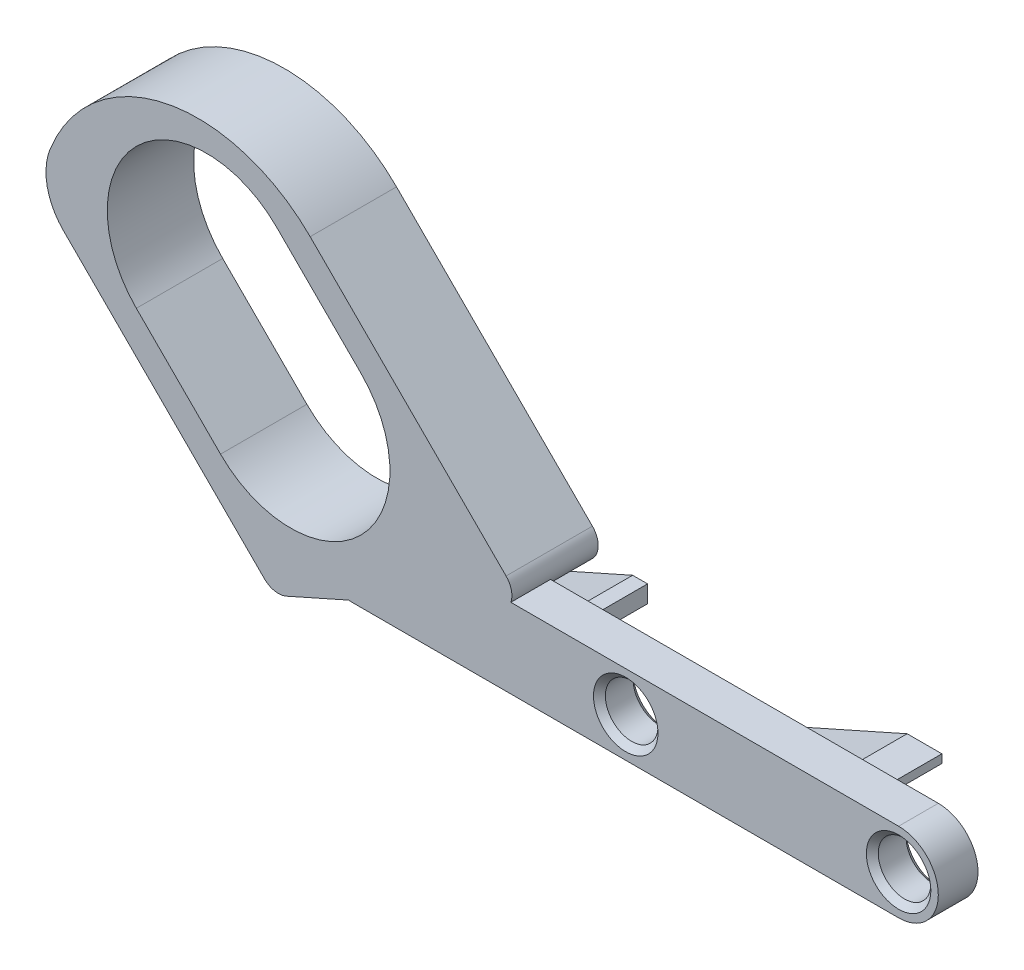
ISO-10303-21;
HEADER;
FILE_DESCRIPTION(('STEP AP214'),'2;1');
FILE_NAME('part.step','',(''),(''),'','','');
FILE_SCHEMA(('AUTOMOTIVE_DESIGN { 1 0 10303 214 1 1 1 1 }'));
ENDSEC;
DATA;
#1=APPLICATION_CONTEXT('core data for automotive mechanical design processes');
#2=APPLICATION_PROTOCOL_DEFINITION('international standard','automotive_design',2000,#1);
#3=PRODUCT_CONTEXT('',#1,'mechanical');
#4=PRODUCT('Part','Part','',(#3));
#5=PRODUCT_RELATED_PRODUCT_CATEGORY('part','',(#4));
#6=PRODUCT_DEFINITION_FORMATION('','',#4);
#7=PRODUCT_DEFINITION_CONTEXT('part definition',#1,'design');
#8=PRODUCT_DEFINITION('design','',#6,#7);
#9=PRODUCT_DEFINITION_SHAPE('','',#8);
#10=(LENGTH_UNIT() NAMED_UNIT(*) SI_UNIT(.MILLI.,.METRE.));
#11=(NAMED_UNIT(*) PLANE_ANGLE_UNIT() SI_UNIT($,.RADIAN.));
#12=(NAMED_UNIT(*) SI_UNIT($,.STERADIAN.) SOLID_ANGLE_UNIT());
#13=UNCERTAINTY_MEASURE_WITH_UNIT(LENGTH_MEASURE(1.E-05),#10,'distance_accuracy_value','');
#14=(GEOMETRIC_REPRESENTATION_CONTEXT(3) GLOBAL_UNCERTAINTY_ASSIGNED_CONTEXT((#13)) GLOBAL_UNIT_ASSIGNED_CONTEXT((#10,
#11,#12)) REPRESENTATION_CONTEXT('',''));
#15=CARTESIAN_POINT('',(0.,0.,0.));
#16=DIRECTION('',(0.,0.,1.));
#17=DIRECTION('',(1.,0.,0.));
#18=AXIS2_PLACEMENT_3D('',#15,#16,#17);
#19=CARTESIAN_POINT('',(-27.5,0.,0.));
#20=DIRECTION('',(0.,0.,1.));
#21=DIRECTION('',(1.,0.,0.));
#22=AXIS2_PLACEMENT_3D('',#19,#20,#21);
#23=PLANE('',#22);
#24=DIRECTION('',(0.913545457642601,0.406736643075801,0.));
#25=VECTOR('',#24,1.);
#26=CARTESIAN_POINT('',(-26.0911824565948,-3.16425601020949,0.));
#27=LINE('',#26,#25);
#28=CARTESIAN_POINT('',(-27.9188937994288,-3.97800552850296,0.));
#29=VERTEX_POINT('',#28);
#30=CARTESIAN_POINT('',(-12.6584337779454,2.81638902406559,0.));
#31=VERTEX_POINT('',#30);
#32=EDGE_CURVE('E335',#29,#31,#27,.T.);
#33=ORIENTED_EDGE('',*,*,#32,.T.);
#34=CARTESIAN_POINT('',(-13.471907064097,4.64347993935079,0.));
#35=DIRECTION('',(0.,0.,1.));
#36=DIRECTION('',(1.,0.,0.));
#37=AXIS2_PLACEMENT_3D('',#34,#35,#36);
#38=CIRCLE('',#37,2.);
#39=CARTESIAN_POINT('',(-11.5782509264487,4.,0.));
#40=VERTEX_POINT('',#39);
#41=EDGE_CURVE('E341',#31,#40,#38,.T.);
#42=ORIENTED_EDGE('',*,*,#41,.T.);
#43=DIRECTION('',(-1.,0.,0.));
#44=VECTOR('',#43,1.);
#45=CARTESIAN_POINT('',(-27.5,4.,0.));
#46=LINE('',#45,#44);
#47=CARTESIAN_POINT('',(27.5,4.00000000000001,0.));
#48=VERTEX_POINT('',#47);
#49=EDGE_CURVE('E438',#48,#40,#46,.T.);
#50=ORIENTED_EDGE('',*,*,#49,.F.);
#51=CARTESIAN_POINT('',(27.5,0.,0.));
#52=DIRECTION('',(0.,0.,1.));
#53=DIRECTION('',(1.,0.,0.));
#54=AXIS2_PLACEMENT_3D('',#51,#52,#53);
#55=CIRCLE('',#54,4.00000000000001);
#56=CARTESIAN_POINT('',(27.5,-4.00000000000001,0.));
#57=VERTEX_POINT('',#56);
#58=EDGE_CURVE('E449',#57,#48,#55,.T.);
#59=ORIENTED_EDGE('',*,*,#58,.F.);
#60=DIRECTION('',(1.,0.,0.));
#61=VECTOR('',#60,1.);
#62=CARTESIAN_POINT('',(-27.5,-4.,0.));
#63=LINE('',#62,#61);
#64=CARTESIAN_POINT('',(-27.5,-4.,0.));
#65=VERTEX_POINT('',#64);
#66=EDGE_CURVE('E447',#65,#57,#63,.T.);
#67=ORIENTED_EDGE('',*,*,#66,.F.);
#68=CARTESIAN_POINT('',(-27.5,0.,0.));
#69=DIRECTION('',(0.,0.,1.));
#70=DIRECTION('',(1.,0.,0.));
#71=AXIS2_PLACEMENT_3D('',#68,#69,#70);
#72=CIRCLE('',#71,4.);
#73=EDGE_CURVE('E434',#29,#65,#72,.T.);
#74=ORIENTED_EDGE('',*,*,#73,.F.);
#75=EDGE_LOOP('',(#33,#42,#50,#59,#67,#74));
#76=FACE_BOUND('',#75,.T.);
#77=DIRECTION('',(-1.,0.,0.));
#78=VECTOR('',#77,1.);
#79=CARTESIAN_POINT('',(8.,-3.8,0.));
#80=LINE('',#79,#78);
#81=CARTESIAN_POINT('',(8.,-3.8,0.));
#82=VERTEX_POINT('',#81);
#83=CARTESIAN_POINT('',(6.5,-3.8,0.));
#84=VERTEX_POINT('',#83);
#85=EDGE_CURVE('E410',#82,#84,#80,.T.);
#86=ORIENTED_EDGE('',*,*,#85,.F.);
#87=DIRECTION('',(-0.913545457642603,-0.406736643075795,0.));
#88=VECTOR('',#87,1.);
#89=CARTESIAN_POINT('',(23.160974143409,2.95010058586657,0.));
#90=LINE('',#89,#88);
#91=CARTESIAN_POINT('',(23.1609741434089,2.95010058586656,0.));
#92=VERTEX_POINT('',#91);
#93=EDGE_CURVE('E408',#92,#82,#90,.T.);
#94=ORIENTED_EDGE('',*,*,#93,.F.);
#95=DIRECTION('',(0.,-1.,0.));
#96=VECTOR('',#95,1.);
#97=CARTESIAN_POINT('',(23.160974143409,3.80000000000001,0.));
#98=LINE('',#97,#96);
#99=CARTESIAN_POINT('',(23.1609741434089,3.80000000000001,0.));
#100=VERTEX_POINT('',#99);
#101=EDGE_CURVE('E405',#100,#92,#98,.T.);
#102=ORIENTED_EDGE('',*,*,#101,.F.);
#103=DIRECTION('',(1.,0.,0.));
#104=VECTOR('',#103,1.);
#105=CARTESIAN_POINT('',(19.660974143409,3.80000000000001,0.));
#106=LINE('',#105,#104);
#107=CARTESIAN_POINT('',(19.660974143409,3.80000000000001,0.));
#108=VERTEX_POINT('',#107);
#109=EDGE_CURVE('E387',#108,#100,#106,.T.);
#110=ORIENTED_EDGE('',*,*,#109,.F.);
#111=DIRECTION('',(0.913545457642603,0.406736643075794,0.));
#112=VECTOR('',#111,1.);
#113=CARTESIAN_POINT('',(6.5,-2.0596432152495,0.));
#114=LINE('',#113,#112);
#115=CARTESIAN_POINT('',(6.5,-2.0596432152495,0.));
#116=VERTEX_POINT('',#115);
#117=EDGE_CURVE('E392',#116,#108,#114,.T.);
#118=ORIENTED_EDGE('',*,*,#117,.F.);
#119=DIRECTION('',(0.,1.,0.));
#120=VECTOR('',#119,1.);
#121=CARTESIAN_POINT('',(6.5,-3.8,0.));
#122=LINE('',#121,#120);
#123=EDGE_CURVE('E413',#84,#116,#122,.T.);
#124=ORIENTED_EDGE('',*,*,#123,.F.);
#125=EDGE_LOOP('',(#86,#94,#102,#110,#118,#124));
#126=FACE_BOUND('',#125,.T.);
#127=DIRECTION('',(0.913545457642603,0.406736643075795,0.));
#128=VECTOR('',#127,1.);
#129=CARTESIAN_POINT('',(-23.160974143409,-2.95010058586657,0.));
#130=LINE('',#129,#128);
#131=CARTESIAN_POINT('',(-23.160974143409,-2.95010058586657,0.));
#132=VERTEX_POINT('',#131);
#133=CARTESIAN_POINT('',(-8.,3.8,0.));
#134=VERTEX_POINT('',#133);
#135=EDGE_CURVE('E60',#132,#134,#130,.T.);
#136=ORIENTED_EDGE('',*,*,#135,.F.);
#137=DIRECTION('',(0.,1.,0.));
#138=VECTOR('',#137,1.);
#139=CARTESIAN_POINT('',(-23.160974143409,-3.80000000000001,0.));
#140=LINE('',#139,#138);
#141=CARTESIAN_POINT('',(-23.160974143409,-3.80000000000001,0.));
#142=VERTEX_POINT('',#141);
#143=EDGE_CURVE('E363',#142,#132,#140,.T.);
#144=ORIENTED_EDGE('',*,*,#143,.F.);
#145=DIRECTION('',(-1.,0.,0.));
#146=VECTOR('',#145,1.);
#147=CARTESIAN_POINT('',(-19.660974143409,-3.80000000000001,0.));
#148=LINE('',#147,#146);
#149=CARTESIAN_POINT('',(-19.660974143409,-3.80000000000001,0.));
#150=VERTEX_POINT('',#149);
#151=EDGE_CURVE('E344',#150,#142,#148,.T.);
#152=ORIENTED_EDGE('',*,*,#151,.F.);
#153=DIRECTION('',(-0.913545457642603,-0.406736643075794,0.));
#154=VECTOR('',#153,1.);
#155=CARTESIAN_POINT('',(-6.5,2.0596432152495,0.));
#156=LINE('',#155,#154);
#157=CARTESIAN_POINT('',(-6.5,2.0596432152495,0.));
#158=VERTEX_POINT('',#157);
#159=EDGE_CURVE('E349',#158,#150,#156,.T.);
#160=ORIENTED_EDGE('',*,*,#159,.F.);
#161=DIRECTION('',(0.,-1.,0.));
#162=VECTOR('',#161,1.);
#163=CARTESIAN_POINT('',(-6.5,3.8,0.));
#164=LINE('',#163,#162);
#165=CARTESIAN_POINT('',(-6.5,3.8,0.));
#166=VERTEX_POINT('',#165);
#167=EDGE_CURVE('E67',#166,#158,#164,.T.);
#168=ORIENTED_EDGE('',*,*,#167,.F.);
#169=DIRECTION('',(1.,0.,0.));
#170=VECTOR('',#169,1.);
#171=CARTESIAN_POINT('',(-8.,3.8,0.));
#172=LINE('',#171,#170);
#173=EDGE_CURVE('E367',#134,#166,#172,.T.);
#174=ORIENTED_EDGE('',*,*,#173,.F.);
#175=EDGE_LOOP('',(#136,#144,#152,#160,#168,#174));
#176=FACE_BOUND('',#175,.T.);
#177=CARTESIAN_POINT('',(27.5,0.,0.));
#178=DIRECTION('',(0.,0.,1.));
#179=DIRECTION('',(1.,0.,0.));
#180=AXIS2_PLACEMENT_3D('',#177,#178,#179);
#181=CIRCLE('',#180,3.24999999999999);
#182=CARTESIAN_POINT('',(30.75,0.,0.));
#183=VERTEX_POINT('',#182);
#184=EDGE_CURVE('E473',#183,#183,#181,.T.);
#185=ORIENTED_EDGE('',*,*,#184,.T.);
#186=EDGE_LOOP('',(#185));
#187=FACE_BOUND('',#186,.T.);
#188=CARTESIAN_POINT('',(0.,0.,0.));
#189=DIRECTION('',(0.,0.,1.));
#190=DIRECTION('',(1.,0.,0.));
#191=AXIS2_PLACEMENT_3D('',#188,#189,#190);
#192=CIRCLE('',#191,3.25);
#193=CARTESIAN_POINT('',(3.25,0.,0.));
#194=VERTEX_POINT('',#193);
#195=EDGE_CURVE('E461',#194,#194,#192,.T.);
#196=ORIENTED_EDGE('',*,*,#195,.T.);
#197=EDGE_LOOP('',(#196));
#198=FACE_BOUND('',#197,.T.);
#199=ADVANCED_FACE('F44',(#76,#126,#176,#187,#198),#23,.F.);
#200=CARTESIAN_POINT('',(-27.5,0.,4.));
#201=DIRECTION('',(0.,0.,-1.));
#202=DIRECTION('',(-1.,0.,0.));
#203=AXIS2_PLACEMENT_3D('',#200,#201,#202);
#204=CYLINDRICAL_SURFACE('',#203,4.);
#205=CARTESIAN_POINT('',(-27.5,0.,4.));
#206=DIRECTION('',(0.,0.,1.));
#207=DIRECTION('',(1.,0.,0.));
#208=AXIS2_PLACEMENT_3D('',#205,#206,#207);
#209=CIRCLE('',#208,4.);
#210=CARTESIAN_POINT('',(-27.9188937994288,-3.97800552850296,4.));
#211=VERTEX_POINT('',#210);
#212=CARTESIAN_POINT('',(-27.5,-4.,4.));
#213=VERTEX_POINT('',#212);
#214=EDGE_CURVE('E435',#211,#213,#209,.T.);
#215=ORIENTED_EDGE('',*,*,#214,.F.);
#216=DIRECTION('',(0.,0.,-1.));
#217=VECTOR('',#216,1.);
#218=CARTESIAN_POINT('',(-27.9188937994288,-3.97800552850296,4.));
#219=LINE('',#218,#217);
#220=EDGE_CURVE('E295',#211,#29,#219,.T.);
#221=ORIENTED_EDGE('',*,*,#220,.T.);
#222=ORIENTED_EDGE('',*,*,#73,.T.);
#223=DIRECTION('',(0.,0.,-1.));
#224=VECTOR('',#223,1.);
#225=CARTESIAN_POINT('',(-27.5,-4.,4.));
#226=LINE('',#225,#224);
#227=EDGE_CURVE('E458',#213,#65,#226,.T.);
#228=ORIENTED_EDGE('',*,*,#227,.F.);
#229=EDGE_LOOP('',(#215,#221,#222,#228));
#230=FACE_BOUND('',#229,.T.);
#231=ADVANCED_FACE('F500',(#230),#204,.T.);
#232=CARTESIAN_POINT('',(-27.5,-4.,4.));
#233=DIRECTION('',(0.,1.,0.));
#234=DIRECTION('',(0.,0.,1.));
#235=AXIS2_PLACEMENT_3D('',#232,#233,#234);
#236=PLANE('',#235);
#237=ORIENTED_EDGE('',*,*,#66,.T.);
#238=DIRECTION('',(0.,0.,-1.));
#239=VECTOR('',#238,1.);
#240=CARTESIAN_POINT('',(27.5,-4.00000000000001,4.));
#241=LINE('',#240,#239);
#242=CARTESIAN_POINT('',(27.5,-4.00000000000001,4.));
#243=VERTEX_POINT('',#242);
#244=EDGE_CURVE('E455',#243,#57,#241,.T.);
#245=ORIENTED_EDGE('',*,*,#244,.F.);
#246=DIRECTION('',(1.,0.,0.));
#247=VECTOR('',#246,1.);
#248=CARTESIAN_POINT('',(-27.5,-4.,4.));
#249=LINE('',#248,#247);
#250=EDGE_CURVE('E437',#213,#243,#249,.T.);
#251=ORIENTED_EDGE('',*,*,#250,.F.);
#252=ORIENTED_EDGE('',*,*,#227,.T.);
#253=EDGE_LOOP('',(#237,#245,#251,#252));
#254=FACE_BOUND('',#253,.T.);
#255=ADVANCED_FACE('F507',(#254),#236,.F.);
#256=CARTESIAN_POINT('',(27.5,0.,4.));
#257=DIRECTION('',(0.,0.,-1.));
#258=DIRECTION('',(-1.,0.,0.));
#259=AXIS2_PLACEMENT_3D('',#256,#257,#258);
#260=CYLINDRICAL_SURFACE('',#259,4.00000000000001);
#261=ORIENTED_EDGE('',*,*,#58,.T.);
#262=DIRECTION('',(0.,0.,-1.));
#263=VECTOR('',#262,1.);
#264=CARTESIAN_POINT('',(27.5,4.00000000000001,4.));
#265=LINE('',#264,#263);
#266=CARTESIAN_POINT('',(27.5,4.00000000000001,4.));
#267=VERTEX_POINT('',#266);
#268=EDGE_CURVE('E445',#267,#48,#265,.T.);
#269=ORIENTED_EDGE('',*,*,#268,.F.);
#270=CARTESIAN_POINT('',(27.5,0.,4.));
#271=DIRECTION('',(0.,0.,1.));
#272=DIRECTION('',(1.,0.,0.));
#273=AXIS2_PLACEMENT_3D('',#270,#271,#272);
#274=CIRCLE('',#273,4.00000000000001);
#275=EDGE_CURVE('E440',#243,#267,#274,.T.);
#276=ORIENTED_EDGE('',*,*,#275,.F.);
#277=ORIENTED_EDGE('',*,*,#244,.T.);
#278=EDGE_LOOP('',(#261,#269,#276,#277));
#279=FACE_BOUND('',#278,.T.);
#280=ADVANCED_FACE('F517',(#279),#260,.T.);
#281=CARTESIAN_POINT('',(-27.5,4.,4.));
#282=DIRECTION('',(0.,-1.,0.));
#283=DIRECTION('',(1.,0.,0.));
#284=AXIS2_PLACEMENT_3D('',#281,#282,#283);
#285=PLANE('',#284);
#286=ORIENTED_EDGE('',*,*,#49,.T.);
#287=DIRECTION('',(0.,0.,1.));
#288=VECTOR('',#287,1.);
#289=CARTESIAN_POINT('',(-11.5782509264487,4.,-64.7424043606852));
#290=LINE('',#289,#288);
#291=CARTESIAN_POINT('',(-11.5782509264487,4.,4.));
#292=VERTEX_POINT('',#291);
#293=EDGE_CURVE('E338',#40,#292,#290,.T.);
#294=ORIENTED_EDGE('',*,*,#293,.T.);
#295=DIRECTION('',(-1.,0.,0.));
#296=VECTOR('',#295,1.);
#297=CARTESIAN_POINT('',(-27.5,4.,4.));
#298=LINE('',#297,#296);
#299=EDGE_CURVE('E442',#267,#292,#298,.T.);
#300=ORIENTED_EDGE('',*,*,#299,.F.);
#301=ORIENTED_EDGE('',*,*,#268,.T.);
#302=EDGE_LOOP('',(#286,#294,#300,#301));
#303=FACE_BOUND('',#302,.T.);
#304=ADVANCED_FACE('F514',(#303),#285,.F.);
#305=CARTESIAN_POINT('',(-27.5,0.,4.));
#306=DIRECTION('',(0.,0.,1.));
#307=DIRECTION('',(1.,0.,0.));
#308=AXIS2_PLACEMENT_3D('',#305,#306,#307);
#309=PLANE('',#308);
#310=DIRECTION('',(-0.707106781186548,0.707106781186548,0.));
#311=VECTOR('',#310,1.);
#312=CARTESIAN_POINT('',(-26.6899169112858,16.4472762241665,4.));
#313=LINE('',#312,#311);
#314=CARTESIAN_POINT('',(-26.6899169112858,16.4472762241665,4.));
#315=VERTEX_POINT('',#314);
#316=CARTESIAN_POINT('',(-35.1751982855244,24.9325575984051,4.));
#317=VERTEX_POINT('',#316);
#318=EDGE_CURVE('E258',#315,#317,#313,.T.);
#319=ORIENTED_EDGE('',*,*,#318,.F.);
#320=CARTESIAN_POINT('',(-33.7609847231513,9.37620841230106,4.));
#321=DIRECTION('',(0.,0.,1.));
#322=DIRECTION('',(1.,0.,0.));
#323=AXIS2_PLACEMENT_3D('',#320,#321,#322);
#324=CIRCLE('',#323,10.);
#325=CARTESIAN_POINT('',(-40.8320525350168,2.30514060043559,4.));
#326=VERTEX_POINT('',#325);
#327=EDGE_CURVE('E253',#326,#315,#324,.T.);
#328=ORIENTED_EDGE('',*,*,#327,.F.);
#329=DIRECTION('',(0.707106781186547,-0.707106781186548,0.));
#330=VECTOR('',#329,1.);
#331=CARTESIAN_POINT('',(-40.8320525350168,2.30514060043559,4.));
#332=LINE('',#331,#330);
#333=CARTESIAN_POINT('',(-49.3173339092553,10.7904219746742,4.));
#334=VERTEX_POINT('',#333);
#335=EDGE_CURVE('E235',#334,#326,#332,.T.);
#336=ORIENTED_EDGE('',*,*,#335,.F.);
#337=CARTESIAN_POINT('',(-42.2462660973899,17.8614897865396,4.));
#338=DIRECTION('',(0.,0.,1.));
#339=DIRECTION('',(1.,0.,0.));
#340=AXIS2_PLACEMENT_3D('',#337,#338,#339);
#341=CIRCLE('',#340,10.);
#342=EDGE_CURVE('E251',#317,#334,#341,.T.);
#343=ORIENTED_EDGE('',*,*,#342,.F.);
#344=EDGE_LOOP('',(#319,#328,#336,#343));
#345=FACE_BOUND('',#344,.T.);
#346=DIRECTION('',(0.913545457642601,0.406736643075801,0.));
#347=VECTOR('',#346,1.);
#348=CARTESIAN_POINT('',(-12.6584337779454,2.81638902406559,4.));
#349=LINE('',#348,#347);
#350=CARTESIAN_POINT('',(-34.1863059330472,-6.76843719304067,4.));
#351=VERTEX_POINT('',#350);
#352=EDGE_CURVE('E277',#351,#211,#349,.T.);
#353=ORIENTED_EDGE('',*,*,#352,.T.);
#354=ORIENTED_EDGE('',*,*,#214,.T.);
#355=ORIENTED_EDGE('',*,*,#250,.T.);
#356=ORIENTED_EDGE('',*,*,#275,.T.);
#357=ORIENTED_EDGE('',*,*,#299,.T.);
#358=CARTESIAN_POINT('',(-13.471907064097,4.64347993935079,4.));
#359=DIRECTION('',(0.,0.,1.));
#360=DIRECTION('',(1.,0.,0.));
#361=AXIS2_PLACEMENT_3D('',#358,#359,#360);
#362=CIRCLE('',#361,2.);
#363=CARTESIAN_POINT('',(-12.0576935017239,6.05769350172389,4.));
#364=VERTEX_POINT('',#363);
#365=EDGE_CURVE('E275',#292,#364,#362,.T.);
#366=ORIENTED_EDGE('',*,*,#365,.T.);
#367=DIRECTION('',(-0.707106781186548,0.707106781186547,0.));
#368=VECTOR('',#367,1.);
#369=CARTESIAN_POINT('',(-12.0576935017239,6.05769350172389,4.));
#370=LINE('',#369,#368);
#371=CARTESIAN_POINT('',(-31.7992221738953,25.7992221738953,4.));
#372=VERTEX_POINT('',#371);
#373=EDGE_CURVE('E272',#364,#372,#370,.T.);
#374=ORIENTED_EDGE('',*,*,#373,.T.);
#375=CARTESIAN_POINT('',(-43.1129306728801,14.4855136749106,4.));
#376=DIRECTION('',(0.,0.,1.));
#377=DIRECTION('',(1.,0.,0.));
#378=AXIS2_PLACEMENT_3D('',#375,#376,#377);
#379=CIRCLE('',#378,16.);
#380=CARTESIAN_POINT('',(-58.0075991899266,20.3292153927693,4.));
#381=VERTEX_POINT('',#380);
#382=EDGE_CURVE('E269',#372,#381,#379,.T.);
#383=ORIENTED_EDGE('',*,*,#382,.T.);
#384=CARTESIAN_POINT('',(-52.4220984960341,18.1378272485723,4.));
#385=DIRECTION('',(0.,0.,1.));
#386=DIRECTION('',(1.,0.,0.));
#387=AXIS2_PLACEMENT_3D('',#384,#385,#386);
#388=CIRCLE('',#387,6.00000000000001);
#389=CARTESIAN_POINT('',(-56.6647391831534,13.895186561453,4.));
#390=VERTEX_POINT('',#389);
#391=EDGE_CURVE('E266',#381,#390,#388,.T.);
#392=ORIENTED_EDGE('',*,*,#391,.T.);
#393=DIRECTION('',(0.707106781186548,-0.707106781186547,0.));
#394=VECTOR('',#393,1.);
#395=CARTESIAN_POINT('',(-36.4139927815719,-6.35555984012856,4.));
#396=LINE('',#395,#394);
#397=CARTESIAN_POINT('',(-36.4139927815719,-6.35555984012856,4.));
#398=VERTEX_POINT('',#397);
#399=EDGE_CURVE('E263',#390,#398,#396,.T.);
#400=ORIENTED_EDGE('',*,*,#399,.T.);
#401=CARTESIAN_POINT('',(-34.9997792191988,-4.94134627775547,4.));
#402=DIRECTION('',(0.,0.,1.));
#403=DIRECTION('',(1.,0.,0.));
#404=AXIS2_PLACEMENT_3D('',#401,#402,#403);
#405=CIRCLE('',#404,2.);
#406=EDGE_CURVE('E255',#398,#351,#405,.T.);
#407=ORIENTED_EDGE('',*,*,#406,.T.);
#408=EDGE_LOOP('',(#353,#354,#355,#356,#357,#366,#374,#383,#392,#400,#407));
#409=FACE_BOUND('',#408,.T.);
#410=CARTESIAN_POINT('',(27.5,0.,4.));
#411=DIRECTION('',(0.,0.,1.));
#412=DIRECTION('',(1.,0.,0.));
#413=AXIS2_PLACEMENT_3D('',#410,#411,#412);
#414=CIRCLE('',#413,3.24999999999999);
#415=CARTESIAN_POINT('',(30.75,0.,4.));
#416=VERTEX_POINT('',#415);
#417=EDGE_CURVE('E11',#416,#416,#414,.F.);
#418=ORIENTED_EDGE('',*,*,#417,.T.);
#419=EDGE_LOOP('',(#418));
#420=FACE_BOUND('',#419,.T.);
#421=CARTESIAN_POINT('',(0.,0.,4.));
#422=DIRECTION('',(0.,0.,1.));
#423=DIRECTION('',(1.,0.,0.));
#424=AXIS2_PLACEMENT_3D('',#421,#422,#423);
#425=CIRCLE('',#424,3.24999999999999);
#426=CARTESIAN_POINT('',(3.24999999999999,0.,4.));
#427=VERTEX_POINT('',#426);
#428=EDGE_CURVE('E470',#427,#427,#425,.F.);
#429=ORIENTED_EDGE('',*,*,#428,.T.);
#430=EDGE_LOOP('',(#429));
#431=FACE_BOUND('',#430,.T.);
#432=ADVANCED_FACE('F249',(#345,#409,#420,#431),#309,.T.);
#433=CARTESIAN_POINT('',(27.5,0.,0.));
#434=DIRECTION('',(0.,0.,1.));
#435=DIRECTION('',(1.,0.,0.));
#436=AXIS2_PLACEMENT_3D('',#433,#434,#435);
#437=CYLINDRICAL_SURFACE('',#436,2.65);
#438=CARTESIAN_POINT('',(27.5,0.,3.4));
#439=DIRECTION('',(0.,0.,1.));
#440=DIRECTION('',(1.,0.,0.));
#441=AXIS2_PLACEMENT_3D('',#438,#439,#440);
#442=CIRCLE('',#441,2.65);
#443=CARTESIAN_POINT('',(30.15,0.,3.4));
#444=VERTEX_POINT('',#443);
#445=EDGE_CURVE('E53',#444,#444,#442,.T.);
#446=ORIENTED_EDGE('',*,*,#445,.T.);
#447=EDGE_LOOP('',(#446));
#448=FACE_BOUND('',#447,.T.);
#449=CARTESIAN_POINT('',(27.5,0.,0.599999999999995));
#450=DIRECTION('',(0.,0.,1.));
#451=DIRECTION('',(1.,0.,0.));
#452=AXIS2_PLACEMENT_3D('',#449,#450,#451);
#453=CIRCLE('',#452,2.65);
#454=CARTESIAN_POINT('',(30.15,0.,0.599999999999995));
#455=VERTEX_POINT('',#454);
#456=EDGE_CURVE('E476',#455,#455,#453,.F.);
#457=ORIENTED_EDGE('',*,*,#456,.T.);
#458=EDGE_LOOP('',(#457));
#459=FACE_BOUND('',#458,.T.);
#460=ADVANCED_FACE('F481',(#448,#459),#437,.F.);
#461=CARTESIAN_POINT('',(0.,0.,0.));
#462=DIRECTION('',(0.,0.,1.));
#463=DIRECTION('',(1.,0.,0.));
#464=AXIS2_PLACEMENT_3D('',#461,#462,#463);
#465=CYLINDRICAL_SURFACE('',#464,2.65);
#466=CARTESIAN_POINT('',(0.,0.,3.4));
#467=DIRECTION('',(0.,0.,1.));
#468=DIRECTION('',(1.,0.,0.));
#469=AXIS2_PLACEMENT_3D('',#466,#467,#468);
#470=CIRCLE('',#469,2.65);
#471=CARTESIAN_POINT('',(2.65,0.,3.4));
#472=VERTEX_POINT('',#471);
#473=EDGE_CURVE('E467',#472,#472,#470,.T.);
#474=ORIENTED_EDGE('',*,*,#473,.T.);
#475=EDGE_LOOP('',(#474));
#476=FACE_BOUND('',#475,.T.);
#477=CARTESIAN_POINT('',(0.,0.,0.6));
#478=DIRECTION('',(0.,0.,1.));
#479=DIRECTION('',(1.,0.,0.));
#480=AXIS2_PLACEMENT_3D('',#477,#478,#479);
#481=CIRCLE('',#480,2.65);
#482=CARTESIAN_POINT('',(2.65,0.,0.6));
#483=VERTEX_POINT('',#482);
#484=EDGE_CURVE('E464',#483,#483,#481,.F.);
#485=ORIENTED_EDGE('',*,*,#484,.T.);
#486=EDGE_LOOP('',(#485));
#487=FACE_BOUND('',#486,.T.);
#488=ADVANCED_FACE('F532',(#476,#487),#465,.F.);
#489=CARTESIAN_POINT('',(0.,0.,0.));
#490=DIRECTION('',(0.,0.,-1.));
#491=DIRECTION('',(-1.,0.,0.));
#492=AXIS2_PLACEMENT_3D('',#489,#490,#491);
#493=CONICAL_SURFACE('',#492,3.25,0.785398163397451);
#494=ORIENTED_EDGE('',*,*,#484,.F.);
#495=EDGE_LOOP('',(#494));
#496=FACE_BOUND('',#495,.T.);
#497=ORIENTED_EDGE('',*,*,#195,.F.);
#498=EDGE_LOOP('',(#497));
#499=FACE_BOUND('',#498,.T.);
#500=ADVANCED_FACE('F526',(#496,#499),#493,.F.);
#501=CARTESIAN_POINT('',(0.,0.,3.4));
#502=DIRECTION('',(0.,0.,1.));
#503=DIRECTION('',(1.,0.,0.));
#504=AXIS2_PLACEMENT_3D('',#501,#502,#503);
#505=CONICAL_SURFACE('',#504,2.65,0.785398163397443);
#506=ORIENTED_EDGE('',*,*,#428,.F.);
#507=EDGE_LOOP('',(#506));
#508=FACE_BOUND('',#507,.T.);
#509=ORIENTED_EDGE('',*,*,#473,.F.);
#510=EDGE_LOOP('',(#509));
#511=FACE_BOUND('',#510,.T.);
#512=ADVANCED_FACE('F496',(#508,#511),#505,.F.);
#513=CARTESIAN_POINT('',(27.5,0.,0.));
#514=DIRECTION('',(0.,0.,-1.));
#515=DIRECTION('',(-1.,0.,0.));
#516=AXIS2_PLACEMENT_3D('',#513,#514,#515);
#517=CONICAL_SURFACE('',#516,3.24999999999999,0.785398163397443);
#518=ORIENTED_EDGE('',*,*,#456,.F.);
#519=EDGE_LOOP('',(#518));
#520=FACE_BOUND('',#519,.T.);
#521=ORIENTED_EDGE('',*,*,#184,.F.);
#522=EDGE_LOOP('',(#521));
#523=FACE_BOUND('',#522,.T.);
#524=ADVANCED_FACE('F486',(#520,#523),#517,.F.);
#525=CARTESIAN_POINT('',(27.5,0.,3.4));
#526=DIRECTION('',(0.,0.,1.));
#527=DIRECTION('',(1.,0.,0.));
#528=AXIS2_PLACEMENT_3D('',#525,#526,#527);
#529=CONICAL_SURFACE('',#528,2.65,0.785398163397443);
#530=ORIENTED_EDGE('',*,*,#417,.F.);
#531=EDGE_LOOP('',(#530));
#532=FACE_BOUND('',#531,.T.);
#533=ORIENTED_EDGE('',*,*,#445,.F.);
#534=EDGE_LOOP('',(#533));
#535=FACE_BOUND('',#534,.T.);
#536=ADVANCED_FACE('F47',(#532,#535),#529,.F.);
#537=CARTESIAN_POINT('',(19.660974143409,3.80000000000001,-4.7));
#538=DIRECTION('',(0.,-1.,0.));
#539=DIRECTION('',(1.,0.,0.));
#540=AXIS2_PLACEMENT_3D('',#537,#538,#539);
#541=PLANE('',#540);
#542=ORIENTED_EDGE('',*,*,#109,.T.);
#543=DIRECTION('',(0.,0.,1.));
#544=VECTOR('',#543,1.);
#545=CARTESIAN_POINT('',(23.160974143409,3.80000000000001,-4.7));
#546=LINE('',#545,#544);
#547=CARTESIAN_POINT('',(23.160974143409,3.80000000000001,-4.7));
#548=VERTEX_POINT('',#547);
#549=EDGE_CURVE('E431',#548,#100,#546,.T.);
#550=ORIENTED_EDGE('',*,*,#549,.F.);
#551=DIRECTION('',(1.,0.,0.));
#552=VECTOR('',#551,1.);
#553=CARTESIAN_POINT('',(19.660974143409,3.80000000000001,-4.7));
#554=LINE('',#553,#552);
#555=CARTESIAN_POINT('',(19.660974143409,3.80000000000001,-4.7));
#556=VERTEX_POINT('',#555);
#557=EDGE_CURVE('E388',#556,#548,#554,.T.);
#558=ORIENTED_EDGE('',*,*,#557,.F.);
#559=DIRECTION('',(0.,0.,1.));
#560=VECTOR('',#559,1.);
#561=CARTESIAN_POINT('',(19.660974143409,3.80000000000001,-4.7));
#562=LINE('',#561,#560);
#563=EDGE_CURVE('E402',#556,#108,#562,.T.);
#564=ORIENTED_EDGE('',*,*,#563,.T.);
#565=EDGE_LOOP('',(#542,#550,#558,#564));
#566=FACE_BOUND('',#565,.T.);
#567=ADVANCED_FACE('F485',(#566),#541,.F.);
#568=CARTESIAN_POINT('',(23.160974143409,3.80000000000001,-4.7));
#569=DIRECTION('',(-1.,0.,0.));
#570=DIRECTION('',(0.,0.,1.));
#571=AXIS2_PLACEMENT_3D('',#568,#569,#570);
#572=PLANE('',#571);
#573=ORIENTED_EDGE('',*,*,#101,.T.);
#574=DIRECTION('',(0.,0.,1.));
#575=VECTOR('',#574,1.);
#576=CARTESIAN_POINT('',(23.160974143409,2.95010058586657,-4.7));
#577=LINE('',#576,#575);
#578=CARTESIAN_POINT('',(23.160974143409,2.95010058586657,-4.7));
#579=VERTEX_POINT('',#578);
#580=EDGE_CURVE('E428',#579,#92,#577,.T.);
#581=ORIENTED_EDGE('',*,*,#580,.F.);
#582=DIRECTION('',(0.,-1.,0.));
#583=VECTOR('',#582,1.);
#584=CARTESIAN_POINT('',(23.160974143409,3.80000000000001,-4.7));
#585=LINE('',#584,#583);
#586=EDGE_CURVE('E391',#548,#579,#585,.T.);
#587=ORIENTED_EDGE('',*,*,#586,.F.);
#588=ORIENTED_EDGE('',*,*,#549,.T.);
#589=EDGE_LOOP('',(#573,#581,#587,#588));
#590=FACE_BOUND('',#589,.T.);
#591=ADVANCED_FACE('F492',(#590),#572,.F.);
#592=CARTESIAN_POINT('',(23.160974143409,2.95010058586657,-4.7));
#593=DIRECTION('',(-0.406736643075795,0.913545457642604,0.));
#594=DIRECTION('',(-0.913545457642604,-0.406736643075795,0.));
#595=AXIS2_PLACEMENT_3D('',#592,#593,#594);
#596=PLANE('',#595);
#597=ORIENTED_EDGE('',*,*,#93,.T.);
#598=DIRECTION('',(0.,0.,1.));
#599=VECTOR('',#598,1.);
#600=CARTESIAN_POINT('',(8.,-3.8,-4.7));
#601=LINE('',#600,#599);
#602=CARTESIAN_POINT('',(8.,-3.8,-4.7));
#603=VERTEX_POINT('',#602);
#604=EDGE_CURVE('E425',#603,#82,#601,.T.);
#605=ORIENTED_EDGE('',*,*,#604,.F.);
#606=DIRECTION('',(-0.913545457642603,-0.406736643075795,0.));
#607=VECTOR('',#606,1.);
#608=CARTESIAN_POINT('',(23.160974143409,2.95010058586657,-4.7));
#609=LINE('',#608,#607);
#610=EDGE_CURVE('E394',#579,#603,#609,.T.);
#611=ORIENTED_EDGE('',*,*,#610,.F.);
#612=ORIENTED_EDGE('',*,*,#580,.T.);
#613=EDGE_LOOP('',(#597,#605,#611,#612));
#614=FACE_BOUND('',#613,.T.);
#615=ADVANCED_FACE('F561',(#614),#596,.F.);
#616=CARTESIAN_POINT('',(8.,-3.8,-4.7));
#617=DIRECTION('',(0.,1.,0.));
#618=DIRECTION('',(0.,0.,1.));
#619=AXIS2_PLACEMENT_3D('',#616,#617,#618);
#620=PLANE('',#619);
#621=ORIENTED_EDGE('',*,*,#85,.T.);
#622=DIRECTION('',(0.,0.,1.));
#623=VECTOR('',#622,1.);
#624=CARTESIAN_POINT('',(6.5,-3.8,-4.7));
#625=LINE('',#624,#623);
#626=CARTESIAN_POINT('',(6.5,-3.8,-4.7));
#627=VERTEX_POINT('',#626);
#628=EDGE_CURVE('E422',#627,#84,#625,.T.);
#629=ORIENTED_EDGE('',*,*,#628,.F.);
#630=DIRECTION('',(-1.,0.,0.));
#631=VECTOR('',#630,1.);
#632=CARTESIAN_POINT('',(8.,-3.8,-4.7));
#633=LINE('',#632,#631);
#634=EDGE_CURVE('E396',#603,#627,#633,.T.);
#635=ORIENTED_EDGE('',*,*,#634,.F.);
#636=ORIENTED_EDGE('',*,*,#604,.T.);
#637=EDGE_LOOP('',(#621,#629,#635,#636));
#638=FACE_BOUND('',#637,.T.);
#639=ADVANCED_FACE('F565',(#638),#620,.F.);
#640=CARTESIAN_POINT('',(6.5,-3.8,-4.7));
#641=DIRECTION('',(1.,0.,0.));
#642=DIRECTION('',(0.,0.,-1.));
#643=AXIS2_PLACEMENT_3D('',#640,#641,#642);
#644=PLANE('',#643);
#645=ORIENTED_EDGE('',*,*,#123,.T.);
#646=DIRECTION('',(0.,0.,1.));
#647=VECTOR('',#646,1.);
#648=CARTESIAN_POINT('',(6.5,-2.0596432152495,-4.7));
#649=LINE('',#648,#647);
#650=CARTESIAN_POINT('',(6.5,-2.0596432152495,-4.7));
#651=VERTEX_POINT('',#650);
#652=EDGE_CURVE('E419',#651,#116,#649,.T.);
#653=ORIENTED_EDGE('',*,*,#652,.F.);
#654=DIRECTION('',(0.,1.,0.));
#655=VECTOR('',#654,1.);
#656=CARTESIAN_POINT('',(6.5,-3.8,-4.7));
#657=LINE('',#656,#655);
#658=EDGE_CURVE('E398',#627,#651,#657,.T.);
#659=ORIENTED_EDGE('',*,*,#658,.F.);
#660=ORIENTED_EDGE('',*,*,#628,.T.);
#661=EDGE_LOOP('',(#645,#653,#659,#660));
#662=FACE_BOUND('',#661,.T.);
#663=ADVANCED_FACE('F569',(#662),#644,.F.);
#664=CARTESIAN_POINT('',(6.5,-2.0596432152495,-4.7));
#665=DIRECTION('',(0.406736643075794,-0.913545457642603,0.));
#666=DIRECTION('',(0.913545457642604,0.406736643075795,0.));
#667=AXIS2_PLACEMENT_3D('',#664,#665,#666);
#668=PLANE('',#667);
#669=ORIENTED_EDGE('',*,*,#563,.F.);
#670=DIRECTION('',(0.913545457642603,0.406736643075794,0.));
#671=VECTOR('',#670,1.);
#672=CARTESIAN_POINT('',(6.5,-2.0596432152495,-4.7));
#673=LINE('',#672,#671);
#674=EDGE_CURVE('E400',#651,#556,#673,.T.);
#675=ORIENTED_EDGE('',*,*,#674,.F.);
#676=ORIENTED_EDGE('',*,*,#652,.T.);
#677=ORIENTED_EDGE('',*,*,#117,.T.);
#678=EDGE_LOOP('',(#669,#675,#676,#677));
#679=FACE_BOUND('',#678,.T.);
#680=ADVANCED_FACE('F573',(#679),#668,.F.);
#681=CARTESIAN_POINT('',(0.,0.,-4.7));
#682=DIRECTION('',(0.,0.,-1.));
#683=DIRECTION('',(-1.,0.,0.));
#684=AXIS2_PLACEMENT_3D('',#681,#682,#683);
#685=PLANE('',#684);
#686=ORIENTED_EDGE('',*,*,#610,.T.);
#687=ORIENTED_EDGE('',*,*,#634,.T.);
#688=ORIENTED_EDGE('',*,*,#658,.T.);
#689=ORIENTED_EDGE('',*,*,#674,.T.);
#690=ORIENTED_EDGE('',*,*,#557,.T.);
#691=ORIENTED_EDGE('',*,*,#586,.T.);
#692=EDGE_LOOP('',(#686,#687,#688,#689,#690,#691));
#693=FACE_BOUND('',#692,.T.);
#694=ADVANCED_FACE('F577',(#693),#685,.T.);
#695=CARTESIAN_POINT('',(0.,0.,-4.7));
#696=DIRECTION('',(0.,0.,-1.));
#697=DIRECTION('',(1.,0.,0.));
#698=AXIS2_PLACEMENT_3D('',#695,#696,#697);
#699=PLANE('',#698);
#700=DIRECTION('',(-0.913545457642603,-0.406736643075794,0.));
#701=VECTOR('',#700,1.);
#702=CARTESIAN_POINT('',(-6.5,2.0596432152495,-4.7));
#703=LINE('',#702,#701);
#704=CARTESIAN_POINT('',(-6.5,2.0596432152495,-4.7));
#705=VERTEX_POINT('',#704);
#706=CARTESIAN_POINT('',(-19.660974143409,-3.80000000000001,-4.7));
#707=VERTEX_POINT('',#706);
#708=EDGE_CURVE('E358',#705,#707,#703,.T.);
#709=ORIENTED_EDGE('',*,*,#708,.T.);
#710=DIRECTION('',(-1.,0.,0.));
#711=VECTOR('',#710,1.);
#712=CARTESIAN_POINT('',(-19.660974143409,-3.80000000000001,-4.7));
#713=LINE('',#712,#711);
#714=CARTESIAN_POINT('',(-23.160974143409,-3.80000000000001,-4.7));
#715=VERTEX_POINT('',#714);
#716=EDGE_CURVE('E345',#707,#715,#713,.T.);
#717=ORIENTED_EDGE('',*,*,#716,.T.);
#718=DIRECTION('',(0.,1.,0.));
#719=VECTOR('',#718,1.);
#720=CARTESIAN_POINT('',(-23.160974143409,-3.80000000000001,-4.7));
#721=LINE('',#720,#719);
#722=CARTESIAN_POINT('',(-23.160974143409,-2.95010058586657,-4.7));
#723=VERTEX_POINT('',#722);
#724=EDGE_CURVE('E348',#715,#723,#721,.T.);
#725=ORIENTED_EDGE('',*,*,#724,.T.);
#726=DIRECTION('',(0.913545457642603,0.406736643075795,0.));
#727=VECTOR('',#726,1.);
#728=CARTESIAN_POINT('',(-23.160974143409,-2.95010058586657,-4.7));
#729=LINE('',#728,#727);
#730=CARTESIAN_POINT('',(-8.,3.8,-4.7));
#731=VERTEX_POINT('',#730);
#732=EDGE_CURVE('E352',#723,#731,#729,.T.);
#733=ORIENTED_EDGE('',*,*,#732,.T.);
#734=DIRECTION('',(1.,0.,0.));
#735=VECTOR('',#734,1.);
#736=CARTESIAN_POINT('',(-8.,3.8,-4.7));
#737=LINE('',#736,#735);
#738=CARTESIAN_POINT('',(-6.5,3.8,-4.7));
#739=VERTEX_POINT('',#738);
#740=EDGE_CURVE('E354',#731,#739,#737,.T.);
#741=ORIENTED_EDGE('',*,*,#740,.T.);
#742=DIRECTION('',(0.,-1.,0.));
#743=VECTOR('',#742,1.);
#744=CARTESIAN_POINT('',(-6.5,3.8,-4.7));
#745=LINE('',#744,#743);
#746=EDGE_CURVE('E356',#739,#705,#745,.T.);
#747=ORIENTED_EDGE('',*,*,#746,.T.);
#748=EDGE_LOOP('',(#709,#717,#725,#733,#741,#747));
#749=FACE_BOUND('',#748,.T.);
#750=ADVANCED_FACE('F581',(#749),#699,.T.);
#751=CARTESIAN_POINT('',(-23.160974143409,-3.80000000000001,-4.7));
#752=DIRECTION('',(1.,0.,0.));
#753=DIRECTION('',(0.,0.,-1.));
#754=AXIS2_PLACEMENT_3D('',#751,#752,#753);
#755=PLANE('',#754);
#756=ORIENTED_EDGE('',*,*,#143,.T.);
#757=DIRECTION('',(0.,0.,1.));
#758=VECTOR('',#757,1.);
#759=CARTESIAN_POINT('',(-23.160974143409,-2.95010058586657,-4.7));
#760=LINE('',#759,#758);
#761=EDGE_CURVE('E382',#723,#132,#760,.T.);
#762=ORIENTED_EDGE('',*,*,#761,.F.);
#763=ORIENTED_EDGE('',*,*,#724,.F.);
#764=DIRECTION('',(0.,0.,1.));
#765=VECTOR('',#764,1.);
#766=CARTESIAN_POINT('',(-23.160974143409,-3.80000000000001,-4.7));
#767=LINE('',#766,#765);
#768=EDGE_CURVE('E384',#715,#142,#767,.T.);
#769=ORIENTED_EDGE('',*,*,#768,.T.);
#770=EDGE_LOOP('',(#756,#762,#763,#769));
#771=FACE_BOUND('',#770,.T.);
#772=ADVANCED_FACE('F585',(#771),#755,.F.);
#773=CARTESIAN_POINT('',(-19.660974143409,-3.80000000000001,-4.7));
#774=DIRECTION('',(0.,1.,0.));
#775=DIRECTION('',(-1.,0.,0.));
#776=AXIS2_PLACEMENT_3D('',#773,#774,#775);
#777=PLANE('',#776);
#778=ORIENTED_EDGE('',*,*,#151,.T.);
#779=ORIENTED_EDGE('',*,*,#768,.F.);
#780=ORIENTED_EDGE('',*,*,#716,.F.);
#781=DIRECTION('',(0.,0.,1.));
#782=VECTOR('',#781,1.);
#783=CARTESIAN_POINT('',(-19.660974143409,-3.80000000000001,-4.7));
#784=LINE('',#783,#782);
#785=EDGE_CURVE('E360',#707,#150,#784,.T.);
#786=ORIENTED_EDGE('',*,*,#785,.T.);
#787=EDGE_LOOP('',(#778,#779,#780,#786));
#788=FACE_BOUND('',#787,.T.);
#789=ADVANCED_FACE('F587',(#788),#777,.F.);
#790=CARTESIAN_POINT('',(-23.160974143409,-2.95010058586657,-4.7));
#791=DIRECTION('',(0.406736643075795,-0.913545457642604,0.));
#792=DIRECTION('',(0.913545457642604,0.406736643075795,0.));
#793=AXIS2_PLACEMENT_3D('',#790,#791,#792);
#794=PLANE('',#793);
#795=DIRECTION('',(0.,0.,1.));
#796=VECTOR('',#795,1.);
#797=CARTESIAN_POINT('',(-8.,3.8,-4.7));
#798=LINE('',#797,#796);
#799=EDGE_CURVE('E379',#731,#134,#798,.T.);
#800=ORIENTED_EDGE('',*,*,#799,.F.);
#801=ORIENTED_EDGE('',*,*,#732,.F.);
#802=ORIENTED_EDGE('',*,*,#761,.T.);
#803=ORIENTED_EDGE('',*,*,#135,.T.);
#804=EDGE_LOOP('',(#800,#801,#802,#803));
#805=FACE_BOUND('',#804,.T.);
#806=ADVANCED_FACE('F590',(#805),#794,.F.);
#807=CARTESIAN_POINT('',(-6.5,2.0596432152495,-4.7));
#808=DIRECTION('',(-0.406736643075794,0.913545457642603,0.));
#809=DIRECTION('',(-0.913545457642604,-0.406736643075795,0.));
#810=AXIS2_PLACEMENT_3D('',#807,#808,#809);
#811=PLANE('',#810);
#812=ORIENTED_EDGE('',*,*,#159,.T.);
#813=ORIENTED_EDGE('',*,*,#785,.F.);
#814=ORIENTED_EDGE('',*,*,#708,.F.);
#815=DIRECTION('',(0.,0.,1.));
#816=VECTOR('',#815,1.);
#817=CARTESIAN_POINT('',(-6.5,2.0596432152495,-4.7));
#818=LINE('',#817,#816);
#819=EDGE_CURVE('E373',#705,#158,#818,.T.);
#820=ORIENTED_EDGE('',*,*,#819,.T.);
#821=EDGE_LOOP('',(#812,#813,#814,#820));
#822=FACE_BOUND('',#821,.T.);
#823=ADVANCED_FACE('F597',(#822),#811,.F.);
#824=CARTESIAN_POINT('',(-8.,3.8,-4.7));
#825=DIRECTION('',(0.,-1.,0.));
#826=DIRECTION('',(0.,0.,-1.));
#827=AXIS2_PLACEMENT_3D('',#824,#825,#826);
#828=PLANE('',#827);
#829=ORIENTED_EDGE('',*,*,#173,.T.);
#830=DIRECTION('',(0.,0.,1.));
#831=VECTOR('',#830,1.);
#832=CARTESIAN_POINT('',(-6.5,3.8,-4.7));
#833=LINE('',#832,#831);
#834=EDGE_CURVE('E376',#739,#166,#833,.T.);
#835=ORIENTED_EDGE('',*,*,#834,.F.);
#836=ORIENTED_EDGE('',*,*,#740,.F.);
#837=ORIENTED_EDGE('',*,*,#799,.T.);
#838=EDGE_LOOP('',(#829,#835,#836,#837));
#839=FACE_BOUND('',#838,.T.);
#840=ADVANCED_FACE('F598',(#839),#828,.F.);
#841=CARTESIAN_POINT('',(-6.5,3.8,-4.7));
#842=DIRECTION('',(-1.,0.,0.));
#843=DIRECTION('',(0.,0.,1.));
#844=AXIS2_PLACEMENT_3D('',#841,#842,#843);
#845=PLANE('',#844);
#846=ORIENTED_EDGE('',*,*,#167,.T.);
#847=ORIENTED_EDGE('',*,*,#819,.F.);
#848=ORIENTED_EDGE('',*,*,#746,.F.);
#849=ORIENTED_EDGE('',*,*,#834,.T.);
#850=EDGE_LOOP('',(#846,#847,#848,#849));
#851=FACE_BOUND('',#850,.T.);
#852=ADVANCED_FACE('F601',(#851),#845,.F.);
#853=CARTESIAN_POINT('',(-13.471907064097,4.64347993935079,-64.7424043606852));
#854=DIRECTION('',(0.,0.,1.));
#855=DIRECTION('',(1.,0.,0.));
#856=AXIS2_PLACEMENT_3D('',#853,#854,#855);
#857=CYLINDRICAL_SURFACE('',#856,2.);
#858=ORIENTED_EDGE('',*,*,#41,.F.);
#859=DIRECTION('',(0.,0.,1.));
#860=VECTOR('',#859,1.);
#861=CARTESIAN_POINT('',(-12.6584337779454,2.81638902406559,-64.7424043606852));
#862=LINE('',#861,#860);
#863=CARTESIAN_POINT('',(-12.6584337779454,2.81638902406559,-4.7));
#864=VERTEX_POINT('',#863);
#865=EDGE_CURVE('E285',#864,#31,#862,.T.);
#866=ORIENTED_EDGE('',*,*,#865,.F.);
#867=CARTESIAN_POINT('',(-13.471907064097,4.64347993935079,-4.7));
#868=DIRECTION('',(0.,0.,-1.));
#869=DIRECTION('',(-1.,0.,0.));
#870=AXIS2_PLACEMENT_3D('',#867,#868,#869);
#871=CIRCLE('',#870,2.);
#872=CARTESIAN_POINT('',(-12.0576935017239,6.05769350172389,-4.7));
#873=VERTEX_POINT('',#872);
#874=EDGE_CURVE('E315',#864,#873,#871,.F.);
#875=ORIENTED_EDGE('',*,*,#874,.T.);
#876=DIRECTION('',(0.,0.,1.));
#877=VECTOR('',#876,1.);
#878=CARTESIAN_POINT('',(-12.0576935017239,6.05769350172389,-64.7424043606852));
#879=LINE('',#878,#877);
#880=EDGE_CURVE('E286',#873,#364,#879,.T.);
#881=ORIENTED_EDGE('',*,*,#880,.T.);
#882=ORIENTED_EDGE('',*,*,#365,.F.);
#883=ORIENTED_EDGE('',*,*,#293,.F.);
#884=EDGE_LOOP('',(#858,#866,#875,#881,#882,#883));
#885=FACE_BOUND('',#884,.T.);
#886=ADVANCED_FACE('F605',(#885),#857,.T.);
#887=CARTESIAN_POINT('',(-12.6584337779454,2.81638902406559,-64.7424043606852));
#888=DIRECTION('',(0.406736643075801,-0.913545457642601,0.));
#889=DIRECTION('',(0.913545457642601,0.406736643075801,0.));
#890=AXIS2_PLACEMENT_3D('',#887,#888,#889);
#891=PLANE('',#890);
#892=ORIENTED_EDGE('',*,*,#32,.F.);
#893=ORIENTED_EDGE('',*,*,#220,.F.);
#894=ORIENTED_EDGE('',*,*,#352,.F.);
#895=DIRECTION('',(0.,0.,1.));
#896=VECTOR('',#895,1.);
#897=CARTESIAN_POINT('',(-34.1863059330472,-6.76843719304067,-64.7424043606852));
#898=LINE('',#897,#896);
#899=CARTESIAN_POINT('',(-34.1863059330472,-6.76843719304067,-4.7));
#900=VERTEX_POINT('',#899);
#901=EDGE_CURVE('E298',#900,#351,#898,.T.);
#902=ORIENTED_EDGE('',*,*,#901,.F.);
#903=DIRECTION('',(0.913545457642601,0.406736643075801,0.));
#904=VECTOR('',#903,1.);
#905=CARTESIAN_POINT('',(-12.6584337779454,2.81638902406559,-4.7));
#906=LINE('',#905,#904);
#907=EDGE_CURVE('E282',#900,#864,#906,.T.);
#908=ORIENTED_EDGE('',*,*,#907,.T.);
#909=ORIENTED_EDGE('',*,*,#865,.T.);
#910=EDGE_LOOP('',(#892,#893,#894,#902,#908,#909));
#911=FACE_BOUND('',#910,.T.);
#912=ADVANCED_FACE('F618',(#911),#891,.T.);
#913=CARTESIAN_POINT('',(-33.7609847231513,9.37620841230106,-64.7424043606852));
#914=DIRECTION('',(0.,0.,1.));
#915=DIRECTION('',(1.,0.,0.));
#916=AXIS2_PLACEMENT_3D('',#913,#914,#915);
#917=CYLINDRICAL_SURFACE('',#916,10.);
#918=ORIENTED_EDGE('',*,*,#327,.T.);
#919=DIRECTION('',(0.,0.,1.));
#920=VECTOR('',#919,1.);
#921=CARTESIAN_POINT('',(-26.6899169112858,16.4472762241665,-64.7424043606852));
#922=LINE('',#921,#920);
#923=CARTESIAN_POINT('',(-26.6899169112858,16.4472762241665,-4.7));
#924=VERTEX_POINT('',#923);
#925=EDGE_CURVE('E292',#924,#315,#922,.T.);
#926=ORIENTED_EDGE('',*,*,#925,.F.);
#927=CARTESIAN_POINT('',(-33.7609847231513,9.37620841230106,-4.7));
#928=DIRECTION('',(0.,0.,-1.));
#929=DIRECTION('',(-1.,0.,0.));
#930=AXIS2_PLACEMENT_3D('',#927,#928,#929);
#931=CIRCLE('',#930,10.);
#932=CARTESIAN_POINT('',(-40.8320525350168,2.30514060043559,-4.7));
#933=VERTEX_POINT('',#932);
#934=EDGE_CURVE('E287',#933,#924,#931,.F.);
#935=ORIENTED_EDGE('',*,*,#934,.F.);
#936=DIRECTION('',(0.,0.,1.));
#937=VECTOR('',#936,1.);
#938=CARTESIAN_POINT('',(-40.8320525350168,2.30514060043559,-64.7424043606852));
#939=LINE('',#938,#937);
#940=EDGE_CURVE('E243',#933,#326,#939,.T.);
#941=ORIENTED_EDGE('',*,*,#940,.T.);
#942=EDGE_LOOP('',(#918,#926,#935,#941));
#943=FACE_BOUND('',#942,.T.);
#944=ADVANCED_FACE('F614',(#943),#917,.F.);
#945=CARTESIAN_POINT('',(-34.9997792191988,-4.94134627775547,-64.7424043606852));
#946=DIRECTION('',(0.,0.,1.));
#947=DIRECTION('',(1.,0.,0.));
#948=AXIS2_PLACEMENT_3D('',#945,#946,#947);
#949=CYLINDRICAL_SURFACE('',#948,2.);
#950=DIRECTION('',(0.,0.,1.));
#951=VECTOR('',#950,1.);
#952=CARTESIAN_POINT('',(-36.4139927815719,-6.35555984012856,-64.7424043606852));
#953=LINE('',#952,#951);
#954=CARTESIAN_POINT('',(-36.4139927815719,-6.35555984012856,-4.7));
#955=VERTEX_POINT('',#954);
#956=EDGE_CURVE('E302',#955,#398,#953,.T.);
#957=ORIENTED_EDGE('',*,*,#956,.F.);
#958=CARTESIAN_POINT('',(-34.9997792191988,-4.94134627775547,-4.7));
#959=DIRECTION('',(0.,0.,-1.));
#960=DIRECTION('',(-1.,0.,0.));
#961=AXIS2_PLACEMENT_3D('',#958,#959,#960);
#962=CIRCLE('',#961,2.);
#963=EDGE_CURVE('E254',#955,#900,#962,.F.);
#964=ORIENTED_EDGE('',*,*,#963,.T.);
#965=ORIENTED_EDGE('',*,*,#901,.T.);
#966=ORIENTED_EDGE('',*,*,#406,.F.);
#967=EDGE_LOOP('',(#957,#964,#965,#966));
#968=FACE_BOUND('',#967,.T.);
#969=ADVANCED_FACE('F617',(#968),#949,.T.);
#970=CARTESIAN_POINT('',(-36.4139927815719,-6.35555984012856,-64.7424043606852));
#971=DIRECTION('',(-0.707106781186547,-0.707106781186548,0.));
#972=DIRECTION('',(0.707106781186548,-0.707106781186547,0.));
#973=AXIS2_PLACEMENT_3D('',#970,#971,#972);
#974=PLANE('',#973);
#975=DIRECTION('',(0.,0.,1.));
#976=VECTOR('',#975,1.);
#977=CARTESIAN_POINT('',(-56.6647391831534,13.895186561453,-64.7424043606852));
#978=LINE('',#977,#976);
#979=CARTESIAN_POINT('',(-56.6647391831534,13.895186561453,-4.7));
#980=VERTEX_POINT('',#979);
#981=EDGE_CURVE('E306',#980,#390,#978,.T.);
#982=ORIENTED_EDGE('',*,*,#981,.F.);
#983=DIRECTION('',(0.707106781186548,-0.707106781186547,0.));
#984=VECTOR('',#983,1.);
#985=CARTESIAN_POINT('',(-36.4139927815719,-6.35555984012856,-4.7));
#986=LINE('',#985,#984);
#987=EDGE_CURVE('E299',#980,#955,#986,.T.);
#988=ORIENTED_EDGE('',*,*,#987,.T.);
#989=ORIENTED_EDGE('',*,*,#956,.T.);
#990=ORIENTED_EDGE('',*,*,#399,.F.);
#991=EDGE_LOOP('',(#982,#988,#989,#990));
#992=FACE_BOUND('',#991,.T.);
#993=ADVANCED_FACE('F630',(#992),#974,.T.);
#994=CARTESIAN_POINT('',(-52.4220984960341,18.1378272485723,-64.7424043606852));
#995=DIRECTION('',(0.,0.,1.));
#996=DIRECTION('',(1.,0.,0.));
#997=AXIS2_PLACEMENT_3D('',#994,#995,#996);
#998=CYLINDRICAL_SURFACE('',#997,6.00000000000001);
#999=DIRECTION('',(0.,0.,1.));
#1000=VECTOR('',#999,1.);
#1001=CARTESIAN_POINT('',(-58.0075991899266,20.3292153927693,-64.7424043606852));
#1002=LINE('',#1001,#1000);
#1003=CARTESIAN_POINT('',(-58.0075991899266,20.3292153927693,-4.7));
#1004=VERTEX_POINT('',#1003);
#1005=EDGE_CURVE('E310',#1004,#381,#1002,.T.);
#1006=ORIENTED_EDGE('',*,*,#1005,.F.);
#1007=CARTESIAN_POINT('',(-52.4220984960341,18.1378272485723,-4.7));
#1008=DIRECTION('',(0.,0.,-1.));
#1009=DIRECTION('',(-1.,0.,0.));
#1010=AXIS2_PLACEMENT_3D('',#1007,#1008,#1009);
#1011=CIRCLE('',#1010,6.00000000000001);
#1012=EDGE_CURVE('E303',#1004,#980,#1011,.F.);
#1013=ORIENTED_EDGE('',*,*,#1012,.T.);
#1014=ORIENTED_EDGE('',*,*,#981,.T.);
#1015=ORIENTED_EDGE('',*,*,#391,.F.);
#1016=EDGE_LOOP('',(#1006,#1013,#1014,#1015));
#1017=FACE_BOUND('',#1016,.T.);
#1018=ADVANCED_FACE('F634',(#1017),#998,.T.);
#1019=CARTESIAN_POINT('',(-43.1129306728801,14.4855136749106,-64.7424043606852));
#1020=DIRECTION('',(0.,0.,1.));
#1021=DIRECTION('',(1.,0.,0.));
#1022=AXIS2_PLACEMENT_3D('',#1019,#1020,#1021);
#1023=CYLINDRICAL_SURFACE('',#1022,16.);
#1024=DIRECTION('',(0.,0.,1.));
#1025=VECTOR('',#1024,1.);
#1026=CARTESIAN_POINT('',(-31.7992221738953,25.7992221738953,-64.7424043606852));
#1027=LINE('',#1026,#1025);
#1028=CARTESIAN_POINT('',(-31.7992221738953,25.7992221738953,-4.7));
#1029=VERTEX_POINT('',#1028);
#1030=EDGE_CURVE('E314',#1029,#372,#1027,.T.);
#1031=ORIENTED_EDGE('',*,*,#1030,.F.);
#1032=CARTESIAN_POINT('',(-43.1129306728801,14.4855136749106,-4.7));
#1033=DIRECTION('',(0.,0.,-1.));
#1034=DIRECTION('',(-1.,0.,0.));
#1035=AXIS2_PLACEMENT_3D('',#1032,#1033,#1034);
#1036=CIRCLE('',#1035,16.);
#1037=EDGE_CURVE('E307',#1029,#1004,#1036,.F.);
#1038=ORIENTED_EDGE('',*,*,#1037,.T.);
#1039=ORIENTED_EDGE('',*,*,#1005,.T.);
#1040=ORIENTED_EDGE('',*,*,#382,.F.);
#1041=EDGE_LOOP('',(#1031,#1038,#1039,#1040));
#1042=FACE_BOUND('',#1041,.T.);
#1043=ADVANCED_FACE('F638',(#1042),#1023,.T.);
#1044=CARTESIAN_POINT('',(-12.0576935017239,6.05769350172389,-64.7424043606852));
#1045=DIRECTION('',(0.707106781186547,0.707106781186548,0.));
#1046=DIRECTION('',(-0.707106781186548,0.707106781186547,0.));
#1047=AXIS2_PLACEMENT_3D('',#1044,#1045,#1046);
#1048=PLANE('',#1047);
#1049=ORIENTED_EDGE('',*,*,#880,.F.);
#1050=DIRECTION('',(-0.707106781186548,0.707106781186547,0.));
#1051=VECTOR('',#1050,1.);
#1052=CARTESIAN_POINT('',(-12.0576935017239,6.05769350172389,-4.7));
#1053=LINE('',#1052,#1051);
#1054=EDGE_CURVE('E311',#873,#1029,#1053,.T.);
#1055=ORIENTED_EDGE('',*,*,#1054,.T.);
#1056=ORIENTED_EDGE('',*,*,#1030,.T.);
#1057=ORIENTED_EDGE('',*,*,#373,.F.);
#1058=EDGE_LOOP('',(#1049,#1055,#1056,#1057));
#1059=FACE_BOUND('',#1058,.T.);
#1060=ADVANCED_FACE('F622',(#1059),#1048,.T.);
#1061=CARTESIAN_POINT('',(-40.8320525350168,2.30514060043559,-64.7424043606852));
#1062=DIRECTION('',(-0.707106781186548,-0.707106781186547,0.));
#1063=DIRECTION('',(0.707106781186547,-0.707106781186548,0.));
#1064=AXIS2_PLACEMENT_3D('',#1061,#1062,#1063);
#1065=PLANE('',#1064);
#1066=DIRECTION('',(0.707106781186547,-0.707106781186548,0.));
#1067=VECTOR('',#1066,1.);
#1068=CARTESIAN_POINT('',(-40.8320525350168,2.30514060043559,-4.7));
#1069=LINE('',#1068,#1067);
#1070=CARTESIAN_POINT('',(-49.3173339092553,10.7904219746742,-4.7));
#1071=VERTEX_POINT('',#1070);
#1072=EDGE_CURVE('E237',#1071,#933,#1069,.T.);
#1073=ORIENTED_EDGE('',*,*,#1072,.F.);
#1074=DIRECTION('',(0.,0.,1.));
#1075=VECTOR('',#1074,1.);
#1076=CARTESIAN_POINT('',(-49.3173339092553,10.7904219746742,-64.7424043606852));
#1077=LINE('',#1076,#1075);
#1078=EDGE_CURVE('E231',#1071,#334,#1077,.T.);
#1079=ORIENTED_EDGE('',*,*,#1078,.T.);
#1080=ORIENTED_EDGE('',*,*,#335,.T.);
#1081=ORIENTED_EDGE('',*,*,#940,.F.);
#1082=EDGE_LOOP('',(#1073,#1079,#1080,#1081));
#1083=FACE_BOUND('',#1082,.T.);
#1084=ADVANCED_FACE('F233',(#1083),#1065,.F.);
#1085=CARTESIAN_POINT('',(-42.2462660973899,17.8614897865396,-64.7424043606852));
#1086=DIRECTION('',(0.,0.,1.));
#1087=DIRECTION('',(1.,0.,0.));
#1088=AXIS2_PLACEMENT_3D('',#1085,#1086,#1087);
#1089=CYLINDRICAL_SURFACE('',#1088,10.);
#1090=CARTESIAN_POINT('',(-42.2462660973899,17.8614897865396,-4.7));
#1091=DIRECTION('',(0.,0.,-1.));
#1092=DIRECTION('',(-1.,0.,0.));
#1093=AXIS2_PLACEMENT_3D('',#1090,#1091,#1092);
#1094=CIRCLE('',#1093,10.);
#1095=CARTESIAN_POINT('',(-35.1751982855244,24.9325575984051,-4.7));
#1096=VERTEX_POINT('',#1095);
#1097=EDGE_CURVE('E293',#1096,#1071,#1094,.F.);
#1098=ORIENTED_EDGE('',*,*,#1097,.F.);
#1099=DIRECTION('',(0.,0.,1.));
#1100=VECTOR('',#1099,1.);
#1101=CARTESIAN_POINT('',(-35.1751982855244,24.9325575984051,-64.7424043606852));
#1102=LINE('',#1101,#1100);
#1103=EDGE_CURVE('E242',#1096,#317,#1102,.T.);
#1104=ORIENTED_EDGE('',*,*,#1103,.T.);
#1105=ORIENTED_EDGE('',*,*,#342,.T.);
#1106=ORIENTED_EDGE('',*,*,#1078,.F.);
#1107=EDGE_LOOP('',(#1098,#1104,#1105,#1106));
#1108=FACE_BOUND('',#1107,.T.);
#1109=ADVANCED_FACE('F257',(#1108),#1089,.F.);
#1110=CARTESIAN_POINT('',(-26.6899169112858,16.4472762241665,-64.7424043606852));
#1111=DIRECTION('',(0.707106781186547,0.707106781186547,0.));
#1112=DIRECTION('',(-0.707106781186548,0.707106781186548,0.));
#1113=AXIS2_PLACEMENT_3D('',#1110,#1111,#1112);
#1114=PLANE('',#1113);
#1115=DIRECTION('',(-0.707106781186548,0.707106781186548,0.));
#1116=VECTOR('',#1115,1.);
#1117=CARTESIAN_POINT('',(-26.6899169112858,16.4472762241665,-4.7));
#1118=LINE('',#1117,#1116);
#1119=EDGE_CURVE('E290',#924,#1096,#1118,.T.);
#1120=ORIENTED_EDGE('',*,*,#1119,.F.);
#1121=ORIENTED_EDGE('',*,*,#925,.T.);
#1122=ORIENTED_EDGE('',*,*,#318,.T.);
#1123=ORIENTED_EDGE('',*,*,#1103,.F.);
#1124=EDGE_LOOP('',(#1120,#1121,#1122,#1123));
#1125=FACE_BOUND('',#1124,.T.);
#1126=ADVANCED_FACE('F612',(#1125),#1114,.F.);
#1127=CARTESIAN_POINT('',(0.,0.,-4.7));
#1128=DIRECTION('',(0.,0.,-1.));
#1129=DIRECTION('',(1.,0.,0.));
#1130=AXIS2_PLACEMENT_3D('',#1127,#1128,#1129);
#1131=PLANE('',#1130);
#1132=ORIENTED_EDGE('',*,*,#963,.F.);
#1133=ORIENTED_EDGE('',*,*,#987,.F.);
#1134=ORIENTED_EDGE('',*,*,#1012,.F.);
#1135=ORIENTED_EDGE('',*,*,#1037,.F.);
#1136=ORIENTED_EDGE('',*,*,#1054,.F.);
#1137=ORIENTED_EDGE('',*,*,#874,.F.);
#1138=ORIENTED_EDGE('',*,*,#907,.F.);
#1139=EDGE_LOOP('',(#1132,#1133,#1134,#1135,#1136,#1137,#1138));
#1140=FACE_BOUND('',#1139,.T.);
#1141=ORIENTED_EDGE('',*,*,#1072,.T.);
#1142=ORIENTED_EDGE('',*,*,#934,.T.);
#1143=ORIENTED_EDGE('',*,*,#1119,.T.);
#1144=ORIENTED_EDGE('',*,*,#1097,.T.);
#1145=EDGE_LOOP('',(#1141,#1142,#1143,#1144));
#1146=FACE_BOUND('',#1145,.T.);
#1147=ADVANCED_FACE('F609',(#1140,#1146),#1131,.T.);
#1148=CLOSED_SHELL('',(#199,#231,#255,#280,#304,#432,#460,#488,#500,#512,#524,#536,#567,#591,
#615,#639,#663,#680,#694,#750,#772,#789,#806,#823,#840,#852,#886,#912,#944,#969,#993,#1018,
#1043,#1060,#1084,#1109,#1126,#1147));
#1149=MANIFOLD_SOLID_BREP('B2',#1148);
#1150=ADVANCED_BREP_SHAPE_REPRESENTATION('',(#18,#1149),#14);
#1151=SHAPE_DEFINITION_REPRESENTATION(#9,#1150);
ENDSEC;
END-ISO-10303-21;
